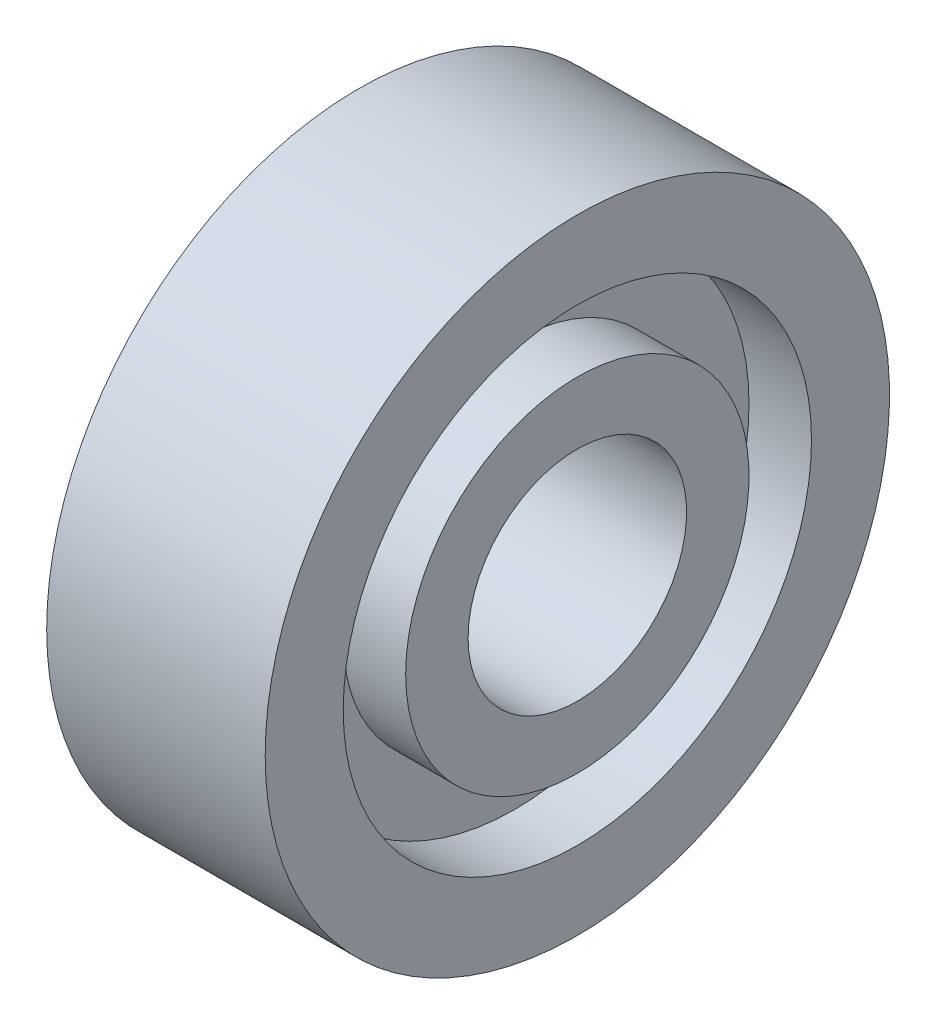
from build123d import *


with BuildPart() as part:
    # Esquisse1 → R_volution1 (revolve)
    with BuildSketch(Plane.XY, mode=Mode.PRIVATE) as r_volution1_sk:
        Polygon((0, 3.5), (0, 10), (7, 10), (7, 7.5), (5, 7.5), (5, 5.5), (7, 5.5), (7, 3.5), align=None)
    revolve(r_volution1_sk.sketch.rotate(Axis((0, 0, 0), (1, 0, 0)), 90), axis=Axis((0, 0, 0), (1, 0, 0)))


solid = part.part
